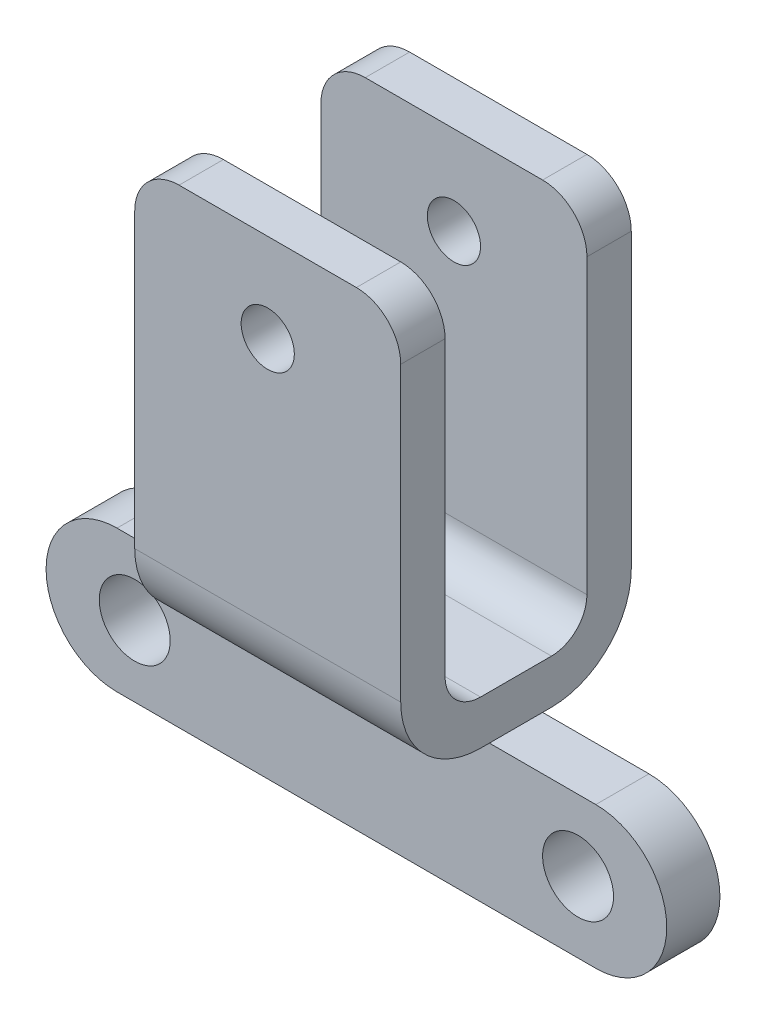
from build123d import *

# Parameters (mm, degrees)
BOSS_EXTRUDE1_DEPTH = 15
FILLET1_R           = 5
SKETCH2_R           = 3
CUT_EXTRUDE1_DEPTH  = 39.783934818
SKETCH3_R           = 4
BOSS_EXTRUDE2_DEPTH = 3


with BuildPart() as part:
    # Sketch1 → Boss-Extrude1 (new, symmetric)
    with BuildSketch(Plane(origin=(0, 0, 0), x_dir=(0, 0, -1), z_dir=(1, 0, 0))):
        with BuildLine():
            Line((-13, 24.56), (-13, -13.44))
            ThreePointArc((-13, -13.44), (-10.363961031, -19.803961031), (-4, -22.44))
            Line((-4, -22.44), (4, -22.44))
            ThreePointArc((4, -22.44), (10.363961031, -19.803961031), (13, -13.44))
            Line((13, -13.44), (13, 24.56))
            Line((13, 24.56), (8, 24.56))
            Line((8, 24.56), (8, -13.44))
            ThreePointArc((8, -13.44), (6.828427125, -16.268427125), (4, -17.44))
            Line((4, -17.44), (-4, -17.44))
            ThreePointArc((-4, -17.44), (-6.828427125, -16.268427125), (-8, -13.44))
            Line((-8, -13.44), (-8, 24.56))
            Line((-8, 24.56), (-13, 24.56))
        make_face()
    extrude(amount=BOSS_EXTRUDE1_DEPTH, both=True)

    # Fillet1
    fillet1_edges = [part.edges().sort_by_distance(p)[0] for p in [
        (-15, 24.56, -10.5),
        (-15, 24.56, 10.5),
        (15, 24.56, -10.5),
        (15, 24.56, 10.5),
    ]]
    fillet(fillet1_edges, radius=FILLET1_R)

    # Sketch2 → Cut-Extrude1 (cut, through all)
    with BuildSketch(Plane.XY.offset(13)):
        with Locations((0, 14.56)):
            Circle(SKETCH2_R)
    extrude(amount=-CUT_EXTRUDE1_DEPTH, mode=Mode.SUBTRACT)

    # Sketch3 → Boss-Extrude2 (add, symmetric)
    with BuildSketch(Plane.XY):
        with BuildLine():
            Line((-27, -22.44), (27, -22.44))
            ThreePointArc((27, -22.44), (35, -30.44), (27, -38.44))
            Line((27, -38.44), (-27, -38.44))
            ThreePointArc((-27, -38.44), (-35, -30.44), (-27, -22.44))
        make_face()
        with Locations((-25, -30.44)):
            Circle(SKETCH3_R, mode=Mode.SUBTRACT)
        with Locations((25, -30.44)):
            Circle(SKETCH3_R, mode=Mode.SUBTRACT)
    extrude(amount=BOSS_EXTRUDE2_DEPTH, both=True)


solid = part.part
